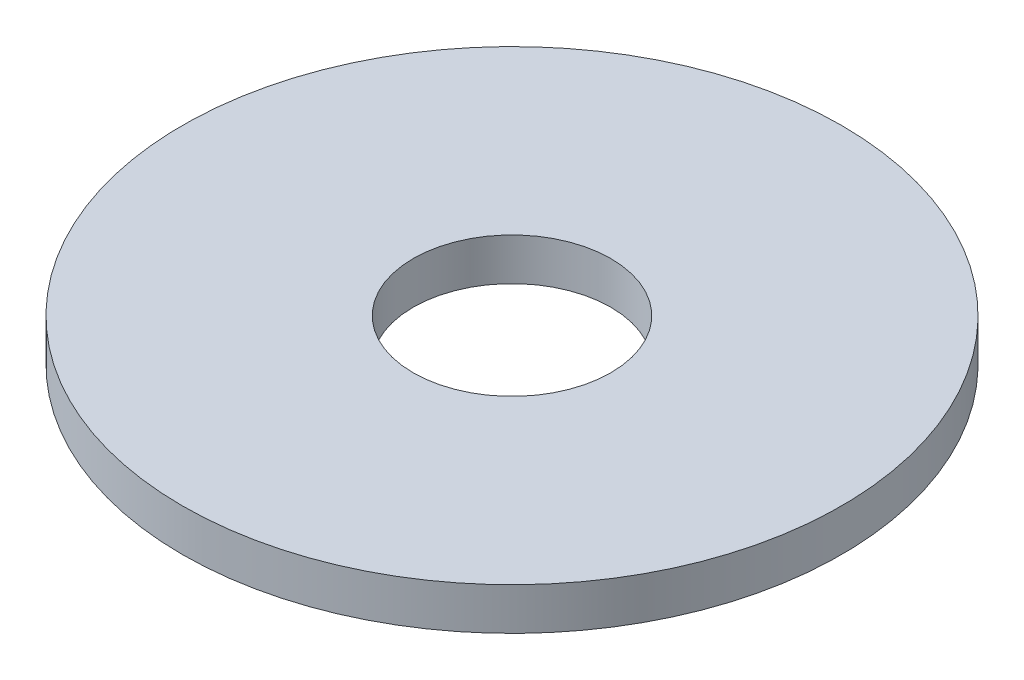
ISO-10303-21;
HEADER;
FILE_DESCRIPTION(('STEP AP214'),'2;1');
FILE_NAME('part.step','',(''),(''),'','','');
FILE_SCHEMA(('AUTOMOTIVE_DESIGN { 1 0 10303 214 1 1 1 1 }'));
ENDSEC;
DATA;
#1=APPLICATION_CONTEXT('core data for automotive mechanical design processes');
#2=APPLICATION_PROTOCOL_DEFINITION('international standard','automotive_design',2000,#1);
#3=PRODUCT_CONTEXT('',#1,'mechanical');
#4=PRODUCT('Part','Part','',(#3));
#5=PRODUCT_RELATED_PRODUCT_CATEGORY('part','',(#4));
#6=PRODUCT_DEFINITION_FORMATION('','',#4);
#7=PRODUCT_DEFINITION_CONTEXT('part definition',#1,'design');
#8=PRODUCT_DEFINITION('design','',#6,#7);
#9=PRODUCT_DEFINITION_SHAPE('','',#8);
#10=(LENGTH_UNIT() NAMED_UNIT(*) SI_UNIT(.MILLI.,.METRE.));
#11=(NAMED_UNIT(*) PLANE_ANGLE_UNIT() SI_UNIT($,.RADIAN.));
#12=(NAMED_UNIT(*) SI_UNIT($,.STERADIAN.) SOLID_ANGLE_UNIT());
#13=UNCERTAINTY_MEASURE_WITH_UNIT(LENGTH_MEASURE(1.E-05),#10,'distance_accuracy_value','');
#14=(GEOMETRIC_REPRESENTATION_CONTEXT(3) GLOBAL_UNCERTAINTY_ASSIGNED_CONTEXT((#13)) GLOBAL_UNIT_ASSIGNED_CONTEXT((#10,
#11,#12)) REPRESENTATION_CONTEXT('',''));
#15=CARTESIAN_POINT('',(0.,0.,0.));
#16=DIRECTION('',(0.,0.,1.));
#17=DIRECTION('',(1.,0.,0.));
#18=AXIS2_PLACEMENT_3D('',#15,#16,#17);
#19=CARTESIAN_POINT('',(0.,2.032,0.));
#20=DIRECTION('',(0.,1.,0.));
#21=DIRECTION('',(0.,0.,1.));
#22=AXIS2_PLACEMENT_3D('',#19,#20,#21);
#23=PLANE('',#22);
#24=CARTESIAN_POINT('',(0.,2.032,0.));
#25=DIRECTION('',(0.,1.,0.));
#26=DIRECTION('',(0.,0.,1.));
#27=AXIS2_PLACEMENT_3D('',#24,#25,#26);
#28=CIRCLE('',#27,15.875);
#29=CARTESIAN_POINT('',(0.,2.032,15.875));
#30=VERTEX_POINT('',#29);
#31=EDGE_CURVE('E10',#30,#30,#28,.T.);
#32=ORIENTED_EDGE('',*,*,#31,.T.);
#33=EDGE_LOOP('',(#32));
#34=FACE_BOUND('',#33,.T.);
#35=CARTESIAN_POINT('',(0.,2.032,0.));
#36=DIRECTION('',(0.,1.,0.));
#37=DIRECTION('',(0.,0.,1.));
#38=AXIS2_PLACEMENT_3D('',#35,#36,#37);
#39=CIRCLE('',#38,4.7625);
#40=CARTESIAN_POINT('',(0.,2.032,4.7625));
#41=VERTEX_POINT('',#40);
#42=EDGE_CURVE('E50',#41,#41,#39,.T.);
#43=ORIENTED_EDGE('',*,*,#42,.F.);
#44=EDGE_LOOP('',(#43));
#45=FACE_BOUND('',#44,.T.);
#46=ADVANCED_FACE('F39',(#34,#45),#23,.T.);
#47=CARTESIAN_POINT('',(0.,0.,0.));
#48=DIRECTION('',(0.,1.,0.));
#49=DIRECTION('',(0.,0.,1.));
#50=AXIS2_PLACEMENT_3D('',#47,#48,#49);
#51=PLANE('',#50);
#52=CARTESIAN_POINT('',(0.,0.,0.));
#53=DIRECTION('',(0.,1.,0.));
#54=DIRECTION('',(0.,0.,1.));
#55=AXIS2_PLACEMENT_3D('',#52,#53,#54);
#56=CIRCLE('',#55,15.875);
#57=CARTESIAN_POINT('',(0.,0.,15.875));
#58=VERTEX_POINT('',#57);
#59=EDGE_CURVE('E43',#58,#58,#56,.T.);
#60=ORIENTED_EDGE('',*,*,#59,.F.);
#61=EDGE_LOOP('',(#60));
#62=FACE_BOUND('',#61,.T.);
#63=CARTESIAN_POINT('',(0.,0.,0.));
#64=DIRECTION('',(0.,1.,0.));
#65=DIRECTION('',(0.,0.,1.));
#66=AXIS2_PLACEMENT_3D('',#63,#64,#65);
#67=CIRCLE('',#66,4.7625);
#68=CARTESIAN_POINT('',(0.,0.,4.7625));
#69=VERTEX_POINT('',#68);
#70=EDGE_CURVE('E52',#69,#69,#67,.T.);
#71=ORIENTED_EDGE('',*,*,#70,.T.);
#72=EDGE_LOOP('',(#71));
#73=FACE_BOUND('',#72,.T.);
#74=ADVANCED_FACE('F62',(#62,#73),#51,.F.);
#75=CARTESIAN_POINT('',(0.,2.032,0.));
#76=DIRECTION('',(0.,-1.,0.));
#77=DIRECTION('',(0.,0.,-1.));
#78=AXIS2_PLACEMENT_3D('',#75,#76,#77);
#79=CYLINDRICAL_SURFACE('',#78,15.875);
#80=ORIENTED_EDGE('',*,*,#31,.F.);
#81=EDGE_LOOP('',(#80));
#82=FACE_BOUND('',#81,.T.);
#83=ORIENTED_EDGE('',*,*,#59,.T.);
#84=EDGE_LOOP('',(#83));
#85=FACE_BOUND('',#84,.T.);
#86=ADVANCED_FACE('F41',(#82,#85),#79,.T.);
#87=CARTESIAN_POINT('',(0.,2.032,0.));
#88=DIRECTION('',(0.,-1.,0.));
#89=DIRECTION('',(0.,0.,-1.));
#90=AXIS2_PLACEMENT_3D('',#87,#88,#89);
#91=CYLINDRICAL_SURFACE('',#90,4.7625);
#92=ORIENTED_EDGE('',*,*,#42,.T.);
#93=EDGE_LOOP('',(#92));
#94=FACE_BOUND('',#93,.T.);
#95=ORIENTED_EDGE('',*,*,#70,.F.);
#96=EDGE_LOOP('',(#95));
#97=FACE_BOUND('',#96,.T.);
#98=ADVANCED_FACE('F58',(#94,#97),#91,.F.);
#99=CLOSED_SHELL('',(#46,#74,#86,#98));
#100=MANIFOLD_SOLID_BREP('B2',#99);
#101=ADVANCED_BREP_SHAPE_REPRESENTATION('',(#18,#100),#14);
#102=SHAPE_DEFINITION_REPRESENTATION(#9,#101);
ENDSEC;
END-ISO-10303-21;
